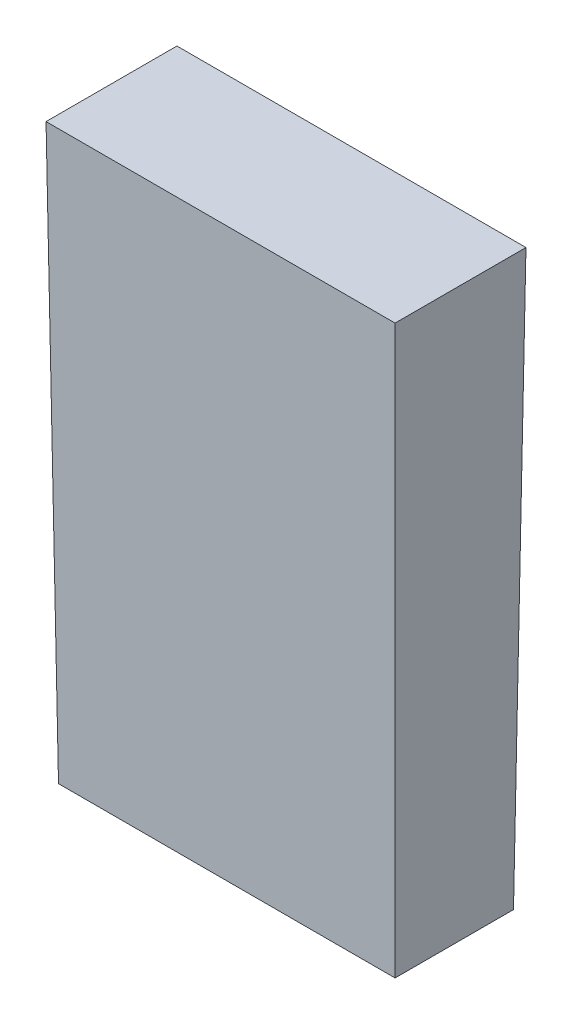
from build123d import *

# Parameters (mm, degrees)
BOSS_EXTRUDE1_DEPTH     = 16.66875
CUT_EXTRUDE1_DEPTH      = 87.893264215
CUT_EXTRUDE1_DEPTH_BACK = 87.893264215


with BuildPart() as part:
    # Sketch1 → Boss-Extrude1 (new body)
    with BuildSketch(Plane.XY):
        Polygon((0, 0), (42.8625, 0), (43.65625, 73.025), (-0.79375, 73.025), align=None)
    extrude(amount=BOSS_EXTRUDE1_DEPTH)

    # Sketch2 → Cut-Extrude1 (cut, two sides: drawn at the far end of the back side and taken through both)
    with BuildSketch(Plane(origin=(0, -0.23292773, 0), x_dir=(0, 0, -1), z_dir=(1, 0, 0)).offset(-CUT_EXTRUDE1_DEPTH_BACK)):
        Polygon((0, 73.25792773), (-0.79375, 0.23292773), (0, 0.23292773), align=None)
        Polygon((-16.66875, 0.23292773), (-15.875, 0.23292773), (-16.66875, 73.25792773), align=None)
    extrude(amount=CUT_EXTRUDE1_DEPTH + CUT_EXTRUDE1_DEPTH_BACK, mode=Mode.SUBTRACT)


solid = part.part
